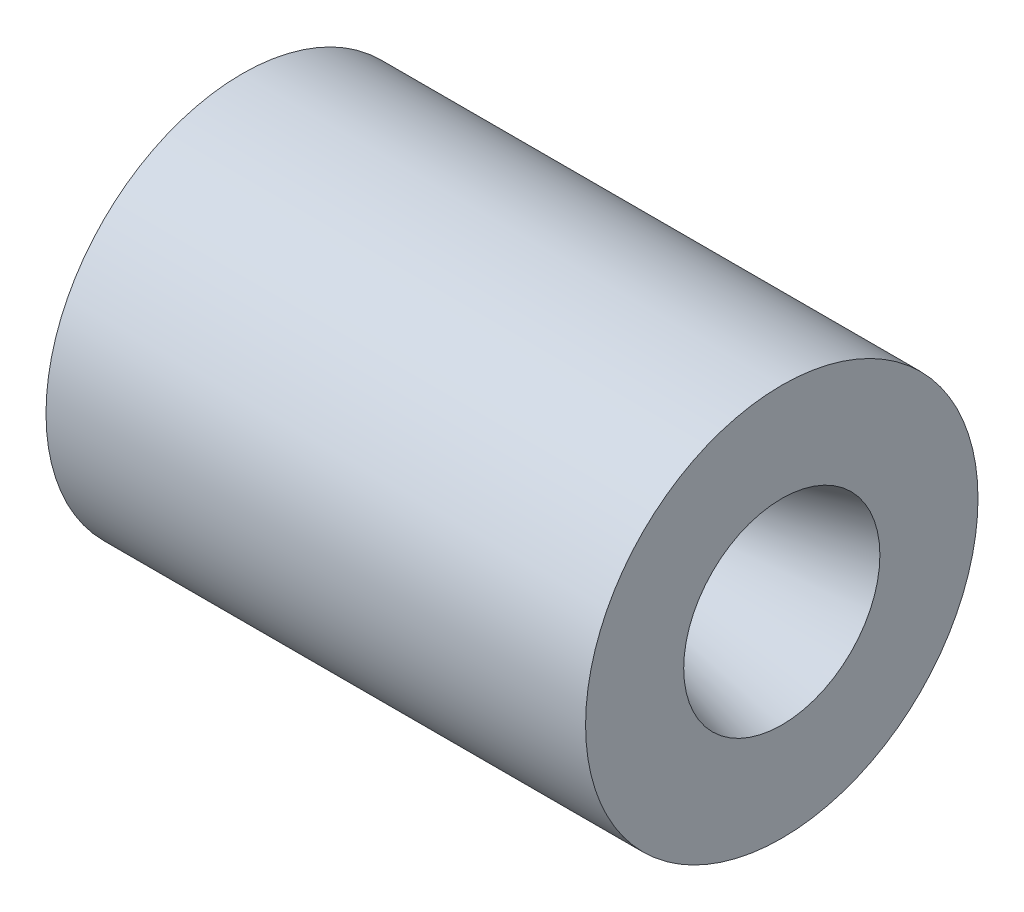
from build123d import *


with BuildPart() as part:
    # Sketch1 → Revolve1 (revolve)
    with BuildSketch(Plane.XY, mode=Mode.PRIVATE) as revolve1_sk:
        Polygon((-1.263961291, 2), (4.236038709, 2), (4.236038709, 1), (0.877192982, 0.1), (0.677192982, 0.1), (-0.01375128, 1.249924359), (-1.263961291, 1.249924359), align=None)
    revolve(revolve1_sk.sketch.rotate(Axis((-0.53091277, 0, 0), (1, 0, 0)), 90), axis=Axis((-0.53091277, 0, 0), (1, 0, 0)))


solid = part.part
